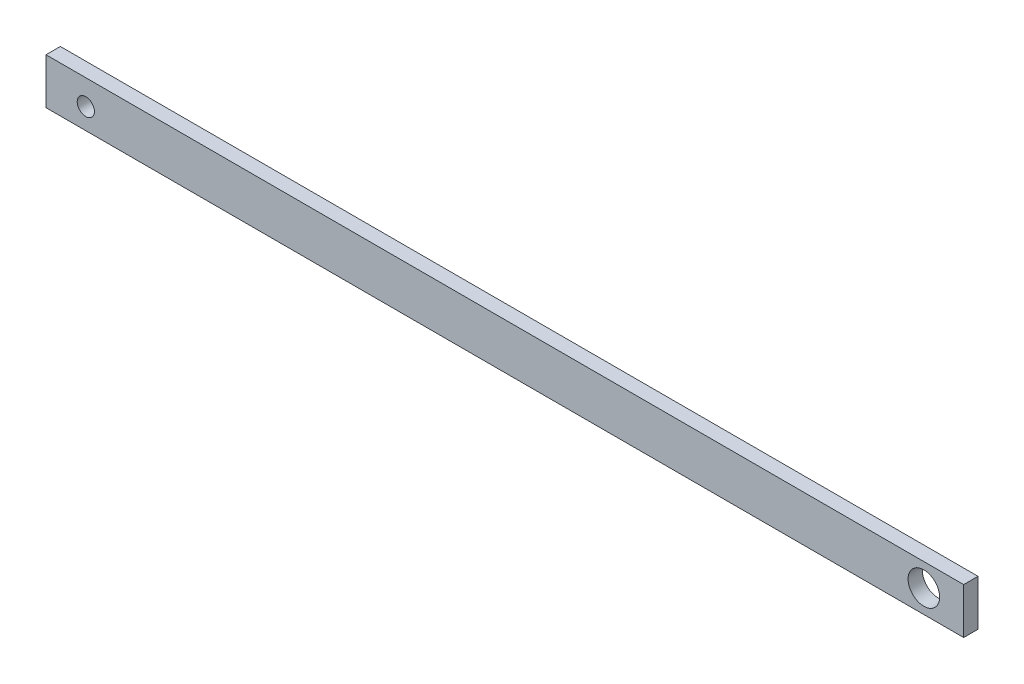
ISO-10303-21;
HEADER;
FILE_DESCRIPTION(('STEP AP214'),'2;1');
FILE_NAME('part.step','',(''),(''),'','','');
FILE_SCHEMA(('AUTOMOTIVE_DESIGN { 1 0 10303 214 1 1 1 1 }'));
ENDSEC;
DATA;
#1=APPLICATION_CONTEXT('core data for automotive mechanical design processes');
#2=APPLICATION_PROTOCOL_DEFINITION('international standard','automotive_design',2000,#1);
#3=PRODUCT_CONTEXT('',#1,'mechanical');
#4=PRODUCT('Part','Part','',(#3));
#5=PRODUCT_RELATED_PRODUCT_CATEGORY('part','',(#4));
#6=PRODUCT_DEFINITION_FORMATION('','',#4);
#7=PRODUCT_DEFINITION_CONTEXT('part definition',#1,'design');
#8=PRODUCT_DEFINITION('design','',#6,#7);
#9=PRODUCT_DEFINITION_SHAPE('','',#8);
#10=(LENGTH_UNIT() NAMED_UNIT(*) SI_UNIT(.MILLI.,.METRE.));
#11=(NAMED_UNIT(*) PLANE_ANGLE_UNIT() SI_UNIT($,.RADIAN.));
#12=(NAMED_UNIT(*) SI_UNIT($,.STERADIAN.) SOLID_ANGLE_UNIT());
#13=UNCERTAINTY_MEASURE_WITH_UNIT(LENGTH_MEASURE(1.E-05),#10,'distance_accuracy_value','');
#14=(GEOMETRIC_REPRESENTATION_CONTEXT(3) GLOBAL_UNCERTAINTY_ASSIGNED_CONTEXT((#13)) GLOBAL_UNIT_ASSIGNED_CONTEXT((#10,
#11,#12)) REPRESENTATION_CONTEXT('',''));
#15=CARTESIAN_POINT('',(0.,0.,0.));
#16=DIRECTION('',(0.,0.,1.));
#17=DIRECTION('',(1.,0.,0.));
#18=AXIS2_PLACEMENT_3D('',#15,#16,#17);
#19=CARTESIAN_POINT('',(0.,0.,2.5));
#20=DIRECTION('',(1.,0.,0.));
#21=DIRECTION('',(0.,0.,-1.));
#22=AXIS2_PLACEMENT_3D('',#19,#20,#21);
#23=PLANE('',#22);
#24=DIRECTION('',(0.,-1.,0.));
#25=VECTOR('',#24,1.);
#26=CARTESIAN_POINT('',(0.,0.,0.));
#27=LINE('',#26,#25);
#28=CARTESIAN_POINT('',(0.,8.,0.));
#29=VERTEX_POINT('',#28);
#30=CARTESIAN_POINT('',(0.,0.,0.));
#31=VERTEX_POINT('',#30);
#32=EDGE_CURVE('E93',#29,#31,#27,.T.);
#33=ORIENTED_EDGE('',*,*,#32,.T.);
#34=DIRECTION('',(0.,0.,-1.));
#35=VECTOR('',#34,1.);
#36=CARTESIAN_POINT('',(0.,0.,2.5));
#37=LINE('',#36,#35);
#38=CARTESIAN_POINT('',(0.,0.,2.5));
#39=VERTEX_POINT('',#38);
#40=EDGE_CURVE('E11',#39,#31,#37,.T.);
#41=ORIENTED_EDGE('',*,*,#40,.F.);
#42=DIRECTION('',(0.,-1.,0.));
#43=VECTOR('',#42,1.);
#44=CARTESIAN_POINT('',(0.,0.,2.5));
#45=LINE('',#44,#43);
#46=CARTESIAN_POINT('',(0.,8.,2.5));
#47=VERTEX_POINT('',#46);
#48=EDGE_CURVE('E81',#47,#39,#45,.T.);
#49=ORIENTED_EDGE('',*,*,#48,.F.);
#50=DIRECTION('',(0.,0.,-1.));
#51=VECTOR('',#50,1.);
#52=CARTESIAN_POINT('',(0.,8.,2.5));
#53=LINE('',#52,#51);
#54=EDGE_CURVE('E89',#47,#29,#53,.T.);
#55=ORIENTED_EDGE('',*,*,#54,.T.);
#56=EDGE_LOOP('',(#33,#41,#49,#55));
#57=FACE_BOUND('',#56,.T.);
#58=ADVANCED_FACE('F30',(#57),#23,.F.);
#59=CARTESIAN_POINT('',(0.,0.,2.5));
#60=DIRECTION('',(0.,1.,0.));
#61=DIRECTION('',(0.,0.,1.));
#62=AXIS2_PLACEMENT_3D('',#59,#60,#61);
#63=PLANE('',#62);
#64=DIRECTION('',(1.,0.,0.));
#65=VECTOR('',#64,1.);
#66=CARTESIAN_POINT('',(0.,0.,0.));
#67=LINE('',#66,#65);
#68=CARTESIAN_POINT('',(160.,0.,0.));
#69=VERTEX_POINT('',#68);
#70=EDGE_CURVE('E85',#31,#69,#67,.T.);
#71=ORIENTED_EDGE('',*,*,#70,.T.);
#72=DIRECTION('',(0.,0.,-1.));
#73=VECTOR('',#72,1.);
#74=CARTESIAN_POINT('',(160.,0.,2.5));
#75=LINE('',#74,#73);
#76=CARTESIAN_POINT('',(160.,0.,2.5));
#77=VERTEX_POINT('',#76);
#78=EDGE_CURVE('E38',#77,#69,#75,.T.);
#79=ORIENTED_EDGE('',*,*,#78,.F.);
#80=DIRECTION('',(1.,0.,0.));
#81=VECTOR('',#80,1.);
#82=CARTESIAN_POINT('',(0.,0.,2.5));
#83=LINE('',#82,#81);
#84=EDGE_CURVE('E76',#39,#77,#83,.T.);
#85=ORIENTED_EDGE('',*,*,#84,.F.);
#86=ORIENTED_EDGE('',*,*,#40,.T.);
#87=EDGE_LOOP('',(#71,#79,#85,#86));
#88=FACE_BOUND('',#87,.T.);
#89=ADVANCED_FACE('F84',(#88),#63,.F.);
#90=CARTESIAN_POINT('',(160.,0.,2.5));
#91=DIRECTION('',(-1.,0.,0.));
#92=DIRECTION('',(0.,0.,1.));
#93=AXIS2_PLACEMENT_3D('',#90,#91,#92);
#94=PLANE('',#93);
#95=DIRECTION('',(0.,1.,0.));
#96=VECTOR('',#95,1.);
#97=CARTESIAN_POINT('',(160.,0.,0.));
#98=LINE('',#97,#96);
#99=CARTESIAN_POINT('',(160.,8.,0.));
#100=VERTEX_POINT('',#99);
#101=EDGE_CURVE('E63',#69,#100,#98,.T.);
#102=ORIENTED_EDGE('',*,*,#101,.T.);
#103=DIRECTION('',(0.,0.,-1.));
#104=VECTOR('',#103,1.);
#105=CARTESIAN_POINT('',(160.,8.,2.5));
#106=LINE('',#105,#104);
#107=CARTESIAN_POINT('',(160.,8.,2.5));
#108=VERTEX_POINT('',#107);
#109=EDGE_CURVE('E86',#108,#100,#106,.T.);
#110=ORIENTED_EDGE('',*,*,#109,.F.);
#111=DIRECTION('',(0.,1.,0.));
#112=VECTOR('',#111,1.);
#113=CARTESIAN_POINT('',(160.,0.,2.5));
#114=LINE('',#113,#112);
#115=EDGE_CURVE('E79',#77,#108,#114,.T.);
#116=ORIENTED_EDGE('',*,*,#115,.F.);
#117=ORIENTED_EDGE('',*,*,#78,.T.);
#118=EDGE_LOOP('',(#102,#110,#116,#117));
#119=FACE_BOUND('',#118,.T.);
#120=ADVANCED_FACE('F87',(#119),#94,.F.);
#121=CARTESIAN_POINT('',(0.,8.,2.5));
#122=DIRECTION('',(0.,-1.,0.));
#123=DIRECTION('',(0.,0.,-1.));
#124=AXIS2_PLACEMENT_3D('',#121,#122,#123);
#125=PLANE('',#124);
#126=DIRECTION('',(-1.,0.,0.));
#127=VECTOR('',#126,1.);
#128=CARTESIAN_POINT('',(0.,8.,0.));
#129=LINE('',#128,#127);
#130=EDGE_CURVE('E69',#100,#29,#129,.T.);
#131=ORIENTED_EDGE('',*,*,#130,.T.);
#132=ORIENTED_EDGE('',*,*,#54,.F.);
#133=DIRECTION('',(-1.,0.,0.));
#134=VECTOR('',#133,1.);
#135=CARTESIAN_POINT('',(0.,8.,2.5));
#136=LINE('',#135,#134);
#137=EDGE_CURVE('E46',#108,#47,#136,.T.);
#138=ORIENTED_EDGE('',*,*,#137,.F.);
#139=ORIENTED_EDGE('',*,*,#109,.T.);
#140=EDGE_LOOP('',(#131,#132,#138,#139));
#141=FACE_BOUND('',#140,.T.);
#142=ADVANCED_FACE('F101',(#141),#125,.F.);
#143=CARTESIAN_POINT('',(0.,8.,2.5));
#144=DIRECTION('',(0.,0.,-1.));
#145=DIRECTION('',(-1.,0.,0.));
#146=AXIS2_PLACEMENT_3D('',#143,#144,#145);
#147=PLANE('',#146);
#148=CARTESIAN_POINT('',(153.06,4.,2.5));
#149=DIRECTION('',(0.,0.,1.));
#150=DIRECTION('',(1.,0.,0.));
#151=AXIS2_PLACEMENT_3D('',#148,#149,#150);
#152=CIRCLE('',#151,2.75000000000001);
#153=CARTESIAN_POINT('',(155.81,4.,2.5));
#154=VERTEX_POINT('',#153);
#155=EDGE_CURVE('E113',#154,#154,#152,.T.);
#156=ORIENTED_EDGE('',*,*,#155,.F.);
#157=EDGE_LOOP('',(#156));
#158=FACE_BOUND('',#157,.T.);
#159=CARTESIAN_POINT('',(6.94,3.63348819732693,2.5));
#160=DIRECTION('',(0.,0.,1.));
#161=DIRECTION('',(1.,0.,0.));
#162=AXIS2_PLACEMENT_3D('',#159,#160,#161);
#163=CIRCLE('',#162,1.5);
#164=CARTESIAN_POINT('',(8.44,3.63348819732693,2.5));
#165=VERTEX_POINT('',#164);
#166=EDGE_CURVE('E107',#165,#165,#163,.T.);
#167=ORIENTED_EDGE('',*,*,#166,.F.);
#168=EDGE_LOOP('',(#167));
#169=FACE_BOUND('',#168,.T.);
#170=ORIENTED_EDGE('',*,*,#48,.T.);
#171=ORIENTED_EDGE('',*,*,#84,.T.);
#172=ORIENTED_EDGE('',*,*,#115,.T.);
#173=ORIENTED_EDGE('',*,*,#137,.T.);
#174=EDGE_LOOP('',(#170,#171,#172,#173));
#175=FACE_BOUND('',#174,.T.);
#176=ADVANCED_FACE('F77',(#158,#169,#175),#147,.F.);
#177=CARTESIAN_POINT('',(0.,8.,0.));
#178=DIRECTION('',(0.,0.,-1.));
#179=DIRECTION('',(-1.,0.,0.));
#180=AXIS2_PLACEMENT_3D('',#177,#178,#179);
#181=PLANE('',#180);
#182=CARTESIAN_POINT('',(153.06,4.,0.));
#183=DIRECTION('',(0.,0.,1.));
#184=DIRECTION('',(1.,0.,0.));
#185=AXIS2_PLACEMENT_3D('',#182,#183,#184);
#186=CIRCLE('',#185,2.75000000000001);
#187=CARTESIAN_POINT('',(155.81,4.,0.));
#188=VERTEX_POINT('',#187);
#189=EDGE_CURVE('E110',#188,#188,#186,.T.);
#190=ORIENTED_EDGE('',*,*,#189,.T.);
#191=EDGE_LOOP('',(#190));
#192=FACE_BOUND('',#191,.T.);
#193=CARTESIAN_POINT('',(6.94,3.63348819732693,0.));
#194=DIRECTION('',(0.,0.,1.));
#195=DIRECTION('',(1.,0.,0.));
#196=AXIS2_PLACEMENT_3D('',#193,#194,#195);
#197=CIRCLE('',#196,1.5);
#198=CARTESIAN_POINT('',(8.44,3.63348819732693,0.));
#199=VERTEX_POINT('',#198);
#200=EDGE_CURVE('E96',#199,#199,#197,.T.);
#201=ORIENTED_EDGE('',*,*,#200,.T.);
#202=EDGE_LOOP('',(#201));
#203=FACE_BOUND('',#202,.T.);
#204=ORIENTED_EDGE('',*,*,#32,.F.);
#205=ORIENTED_EDGE('',*,*,#130,.F.);
#206=ORIENTED_EDGE('',*,*,#101,.F.);
#207=ORIENTED_EDGE('',*,*,#70,.F.);
#208=EDGE_LOOP('',(#204,#205,#206,#207));
#209=FACE_BOUND('',#208,.T.);
#210=ADVANCED_FACE('F104',(#192,#203,#209),#181,.T.);
#211=CARTESIAN_POINT('',(6.94,3.63348819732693,0.));
#212=DIRECTION('',(0.,0.,1.));
#213=DIRECTION('',(1.,0.,0.));
#214=AXIS2_PLACEMENT_3D('',#211,#212,#213);
#215=CYLINDRICAL_SURFACE('',#214,1.5);
#216=ORIENTED_EDGE('',*,*,#200,.F.);
#217=EDGE_LOOP('',(#216));
#218=FACE_BOUND('',#217,.T.);
#219=ORIENTED_EDGE('',*,*,#166,.T.);
#220=EDGE_LOOP('',(#219));
#221=FACE_BOUND('',#220,.T.);
#222=ADVANCED_FACE('F124',(#218,#221),#215,.F.);
#223=CARTESIAN_POINT('',(153.06,4.,0.));
#224=DIRECTION('',(0.,0.,1.));
#225=DIRECTION('',(1.,0.,0.));
#226=AXIS2_PLACEMENT_3D('',#223,#224,#225);
#227=CYLINDRICAL_SURFACE('',#226,2.75000000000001);
#228=ORIENTED_EDGE('',*,*,#189,.F.);
#229=EDGE_LOOP('',(#228));
#230=FACE_BOUND('',#229,.T.);
#231=ORIENTED_EDGE('',*,*,#155,.T.);
#232=EDGE_LOOP('',(#231));
#233=FACE_BOUND('',#232,.T.);
#234=ADVANCED_FACE('F121',(#230,#233),#227,.F.);
#235=CLOSED_SHELL('',(#58,#89,#120,#142,#176,#210,#222,#234));
#236=MANIFOLD_SOLID_BREP('B2',#235);
#237=ADVANCED_BREP_SHAPE_REPRESENTATION('',(#18,#236),#14);
#238=SHAPE_DEFINITION_REPRESENTATION(#9,#237);
ENDSEC;
END-ISO-10303-21;
